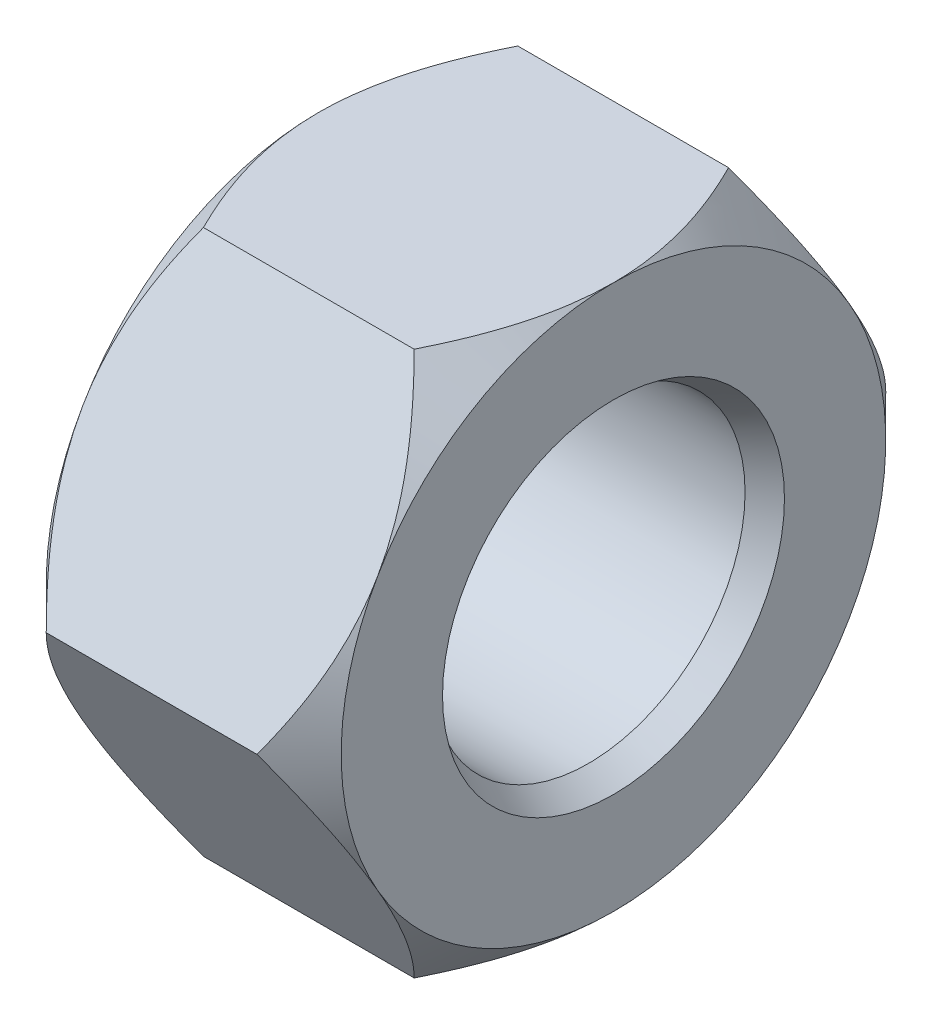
ISO-10303-21;
HEADER;
FILE_DESCRIPTION(('STEP AP214'),'2;1');
FILE_NAME('part.step','',(''),(''),'','','');
FILE_SCHEMA(('AUTOMOTIVE_DESIGN { 1 0 10303 214 1 1 1 1 }'));
ENDSEC;
DATA;
#1=APPLICATION_CONTEXT('core data for automotive mechanical design processes');
#2=APPLICATION_PROTOCOL_DEFINITION('international standard','automotive_design',2000,#1);
#3=PRODUCT_CONTEXT('',#1,'mechanical');
#4=PRODUCT('Part','Part','',(#3));
#5=PRODUCT_RELATED_PRODUCT_CATEGORY('part','',(#4));
#6=PRODUCT_DEFINITION_FORMATION('','',#4);
#7=PRODUCT_DEFINITION_CONTEXT('part definition',#1,'design');
#8=PRODUCT_DEFINITION('design','',#6,#7);
#9=PRODUCT_DEFINITION_SHAPE('','',#8);
#10=(LENGTH_UNIT() NAMED_UNIT(*) SI_UNIT(.MILLI.,.METRE.));
#11=(NAMED_UNIT(*) PLANE_ANGLE_UNIT() SI_UNIT($,.RADIAN.));
#12=(NAMED_UNIT(*) SI_UNIT($,.STERADIAN.) SOLID_ANGLE_UNIT());
#13=UNCERTAINTY_MEASURE_WITH_UNIT(LENGTH_MEASURE(1.E-05),#10,'distance_accuracy_value','');
#14=(GEOMETRIC_REPRESENTATION_CONTEXT(3) GLOBAL_UNCERTAINTY_ASSIGNED_CONTEXT((#13)) GLOBAL_UNIT_ASSIGNED_CONTEXT((#10,
#11,#12)) REPRESENTATION_CONTEXT('',''));
#15=CARTESIAN_POINT('',(0.,0.,0.));
#16=DIRECTION('',(0.,0.,1.));
#17=DIRECTION('',(1.,0.,0.));
#18=AXIS2_PLACEMENT_3D('',#15,#16,#17);
#19=CARTESIAN_POINT('',(5.50000000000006,0.,0.));
#20=DIRECTION('',(1.,0.,0.));
#21=DIRECTION('',(0.,0.,-1.));
#22=AXIS2_PLACEMENT_3D('',#19,#20,#21);
#23=CONICAL_SURFACE('',#22,17.5,0.785398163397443);
#24=CARTESIAN_POINT('',(7.97862016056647,-12.,-15.9732671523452));
#25=CARTESIAN_POINT('',(7.82640630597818,-12.,-15.7828820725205));
#26=CARTESIAN_POINT('',(7.67478830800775,-12.,-15.5920208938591));
#27=CARTESIAN_POINT('',(7.37286198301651,-12.,-15.2092614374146));
#28=CARTESIAN_POINT('',(7.22255367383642,-12.,-15.0173631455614));
#29=CARTESIAN_POINT('',(6.77371822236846,-12.,-14.4399181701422));
#30=CARTESIAN_POINT('',(6.47733985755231,-12.,-14.0526953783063));
#31=CARTESIAN_POINT('',(5.88931829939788,-12.,-13.2700758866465));
#32=CARTESIAN_POINT('',(5.5977277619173,-12.,-12.8746395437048));
#33=CARTESIAN_POINT('',(5.02323102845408,-12.,-12.0775304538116));
#34=CARTESIAN_POINT('',(4.74032425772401,-12.,-11.6758581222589));
#35=CARTESIAN_POINT('',(4.16343396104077,-12.,-10.833203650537));
#36=CARTESIAN_POINT('',(3.870331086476,-12.,-10.3916157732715));
#37=CARTESIAN_POINT('',(3.30013831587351,-12.,-9.49803386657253));
#38=CARTESIAN_POINT('',(3.02305146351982,-12.,-9.04603788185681));
#39=CARTESIAN_POINT('',(2.49061155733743,-12.,-8.13116520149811));
#40=CARTESIAN_POINT('',(2.23519556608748,-12.,-7.66832537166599));
#41=CARTESIAN_POINT('',(1.75178751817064,-12.,-6.72859173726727));
#42=CARTESIAN_POINT('',(1.52378145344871,-12.,-6.25170526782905));
#43=CARTESIAN_POINT('',(1.22290099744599,-12.,-5.55704908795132));
#44=CARTESIAN_POINT('',(1.13534682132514,-12.,-5.34561518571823));
#45=CARTESIAN_POINT('',(0.967871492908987,-12.,-4.91976383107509));
#46=CARTESIAN_POINT('',(0.887950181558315,-12.,-4.70534644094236));
#47=CARTESIAN_POINT('',(0.6609523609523,-12.,-4.05747876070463));
#48=CARTESIAN_POINT('',(0.526624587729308,-12.,-3.61937362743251));
#49=CARTESIAN_POINT('',(0.357702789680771,-12.,-2.95919379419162));
#50=CARTESIAN_POINT('',(0.307216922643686,-12.,-2.741103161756));
#51=CARTESIAN_POINT('',(0.217057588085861,-12.,-2.302708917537));
#52=CARTESIAN_POINT('',(0.177382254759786,-12.,-2.08240569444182));
#53=CARTESIAN_POINT('',(0.109583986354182,-12.,-1.64005709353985));
#54=CARTESIAN_POINT('',(0.0814593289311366,-12.,-1.41801198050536));
#55=CARTESIAN_POINT('',(0.0373213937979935,-12.,-0.972716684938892));
#56=CARTESIAN_POINT('',(0.0213078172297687,-12.,-0.749466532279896));
#57=CARTESIAN_POINT('',(0.00236561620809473,-12.,-0.316879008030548));
#58=CARTESIAN_POINT('',(-0.00134222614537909,-12.,-0.107575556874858));
#59=CARTESIAN_POINT('',(0.0022040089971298,-12.,0.310962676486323));
#60=CARTESIAN_POINT('',(0.00945935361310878,-12.,0.520197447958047));
#61=CARTESIAN_POINT('',(0.0347981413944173,-12.,0.937992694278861));
#62=CARTESIAN_POINT('',(0.0528806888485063,-12.,1.14655322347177));
#63=CARTESIAN_POINT('',(0.099531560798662,-12.,1.56250888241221));
#64=CARTESIAN_POINT('',(0.128101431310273,-12.,1.76990383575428));
#65=CARTESIAN_POINT('',(0.230146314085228,-12.,2.39767661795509));
#66=CARTESIAN_POINT('',(0.319442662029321,-12.,2.81555700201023));
#67=CARTESIAN_POINT('',(0.534054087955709,-12.,3.64171028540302));
#68=CARTESIAN_POINT('',(0.659369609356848,-12.,4.04998306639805));
#69=CARTESIAN_POINT('',(0.939172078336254,-12.,4.85424845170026));
#70=CARTESIAN_POINT('',(1.09352691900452,-12.,5.25028756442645));
#71=CARTESIAN_POINT('',(1.42619691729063,-12.,6.03225436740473));
#72=CARTESIAN_POINT('',(1.60452234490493,-12.,6.41817763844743));
#73=CARTESIAN_POINT('',(1.98090553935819,-12.,7.18166914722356));
#74=CARTESIAN_POINT('',(2.17902202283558,-12.,7.55920820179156));
#75=CARTESIAN_POINT('',(2.59065467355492,-12.,8.30566801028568));
#76=CARTESIAN_POINT('',(2.80416857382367,-12.,8.67459002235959));
#77=CARTESIAN_POINT('',(3.23273430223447,-12.,9.38685361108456));
#78=CARTESIAN_POINT('',(3.44718704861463,-12.,9.73055756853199));
#79=CARTESIAN_POINT('',(3.88530487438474,-12.,10.412060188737));
#80=CARTESIAN_POINT('',(4.10897062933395,-12.,10.7498584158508));
#81=CARTESIAN_POINT('',(4.56208975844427,-12.,11.4176445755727));
#82=CARTESIAN_POINT('',(4.79148350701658,-12.,11.7476731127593));
#83=CARTESIAN_POINT('',(5.2564862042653,-12.,12.4031910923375));
#84=CARTESIAN_POINT('',(5.4920934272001,-12.,12.7286817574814));
#85=CARTESIAN_POINT('',(5.73024656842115,-12.,13.0522658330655));
#86=B_SPLINE_CURVE_WITH_KNOTS('',3,(#24,#25,#26,#27,#28,#29,#30,#31,#32,#33,#34,#35,#36,#37,#38,
#39,#40,#41,#42,#43,#44,#45,#46,#47,#48,#49,#50,#51,#52,#53,#54,#55,#56,#57,#58,#59,#60,#61,#62,
#63,#64,#65,#66,#67,#68,#69,#70,#71,#72,#73,#74,#75,#76,#77,#78,#79,#80,#81,#82,#83,#84,#85),
.UNSPECIFIED.,.F.,.F.,(4,2,2,2,2,2,2,2,2,2,2,2,2,2,2,2,2,2,2,2,2,2,2,2,2,2,2,2,2,2,4),(0.,
0.731256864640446,1.46252367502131,2.92534173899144,4.3992058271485,5.87297215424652,
7.46273072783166,9.05279043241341,10.6380617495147,12.2225194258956,12.9089201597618,
13.5953065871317,14.9679507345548,15.6393089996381,16.3105513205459,16.9816935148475,
17.6528191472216,18.2805439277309,18.9083412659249,19.5360866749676,20.1639246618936,
21.4437965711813,22.7236842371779,23.9978843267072,25.2726320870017,26.5512809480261,
27.829741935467,29.0449308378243,30.260209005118,31.4658937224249,32.6712470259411),.UNSPECIFIED.);
#87=CARTESIAN_POINT('',(1.85640646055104,-12.,6.92820323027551));
#88=VERTEX_POINT('',#87);
#89=CARTESIAN_POINT('',(0.,-12.,0.));
#90=VERTEX_POINT('',#89);
#91=EDGE_CURVE('E289',#88,#90,#86,.F.);
#92=ORIENTED_EDGE('',*,*,#91,.F.);
#93=CARTESIAN_POINT('',(1.85652193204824,0.000200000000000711,13.8565219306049));
#94=CARTESIAN_POINT('',(1.73742850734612,-0.206106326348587,13.737410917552));
#95=CARTESIAN_POINT('',(1.62196918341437,-0.41402835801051,13.6173670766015));
#96=CARTESIAN_POINT('',(1.3994731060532,-0.833355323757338,13.3752685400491));
#97=CARTESIAN_POINT('',(1.29244095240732,-1.04476208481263,13.2532127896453));
#98=CARTESIAN_POINT('',(1.08750030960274,-1.47230711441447,13.006369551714));
#99=CARTESIAN_POINT('',(0.989647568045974,-1.6884655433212,12.8815704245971));
#100=CARTESIAN_POINT('',(0.805191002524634,-2.12433269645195,12.6299224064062));
#101=CARTESIAN_POINT('',(0.718585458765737,-2.3440408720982,12.5030738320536));
#102=CARTESIAN_POINT('',(0.559363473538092,-2.78347501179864,12.2493664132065));
#103=CARTESIAN_POINT('',(0.48654946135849,-3.0031469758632,12.1225387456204));
#104=CARTESIAN_POINT('',(0.354726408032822,-3.4455702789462,11.8671055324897));
#105=CARTESIAN_POINT('',(0.295715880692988,-3.66832128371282,11.7385001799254));
#106=CARTESIAN_POINT('',(0.19298543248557,-4.11594990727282,11.480061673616));
#107=CARTESIAN_POINT('',(0.149231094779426,-4.34082154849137,11.3502319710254));
#108=CARTESIAN_POINT('',(0.0779744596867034,-4.79245266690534,11.0894826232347));
#109=CARTESIAN_POINT('',(0.0504697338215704,-5.01921185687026,10.9585631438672));
#110=CARTESIAN_POINT('',(0.00435195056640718,-5.57180671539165,10.6395223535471));
#111=CARTESIAN_POINT('',(-0.00532569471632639,-5.89823966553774,10.4510562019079));
#112=CARTESIAN_POINT('',(0.0109189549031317,-6.550515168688,10.0744647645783));
#113=CARTESIAN_POINT('',(0.0368537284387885,-6.87635747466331,9.88633962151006));
#114=CARTESIAN_POINT('',(0.122792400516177,-7.52497050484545,9.51186271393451));
#115=CARTESIAN_POINT('',(0.18283439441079,-7.84773738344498,9.32551316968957));
#116=CARTESIAN_POINT('',(0.333723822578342,-8.48772338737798,8.95601707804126));
#117=CARTESIAN_POINT('',(0.424568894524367,-8.80494293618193,8.77287028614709));
#118=CARTESIAN_POINT('',(0.611458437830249,-9.36804564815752,8.44776278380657));
#119=CARTESIAN_POINT('',(0.70258641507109,-9.61517605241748,8.30508197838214));
#120=CARTESIAN_POINT('',(0.899526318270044,-10.1050009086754,8.02228146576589));
#121=CARTESIAN_POINT('',(1.0053386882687,-10.3476952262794,7.88216183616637));
#122=CARTESIAN_POINT('',(1.22927571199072,-10.8278834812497,7.60492501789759));
#123=CARTESIAN_POINT('',(1.3473616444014,-11.0653910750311,7.46779994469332));
#124=CARTESIAN_POINT('',(1.59429570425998,-11.5360086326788,7.19608877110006));
#125=CARTESIAN_POINT('',(1.72313723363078,-11.769121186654,7.06150117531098));
#126=CARTESIAN_POINT('',(1.85652193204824,-12.0002,6.92808776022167));
#127=B_SPLINE_CURVE_WITH_KNOTS('',3,(#93,#94,#95,#96,#97,#98,#99,#100,#101,#102,#103,#104,#105,
#106,#107,#108,#109,#110,#111,#112,#113,#114,#115,#116,#117,#118,#119,#120,#121,#122,#123,#124,
#125,#126),.UNSPECIFIED.,.F.,.F.,(4,2,2,2,2,2,2,2,2,2,2,2,2,2,2,2,4),(0.,0.799031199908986,
1.59849555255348,2.40253734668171,3.20645605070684,3.99780391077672,4.78906652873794,
5.57853238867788,6.36788023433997,7.49728680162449,8.6270892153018,9.75815602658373,
10.8891361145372,11.7873913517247,12.6856737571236,13.58120361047,14.4761880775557),.UNSPECIFIED.);
#128=CARTESIAN_POINT('',(0.,-6.00000000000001,10.3923048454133));
#129=VERTEX_POINT('',#128);
#130=EDGE_CURVE('E152',#129,#88,#127,.T.);
#131=ORIENTED_EDGE('',*,*,#130,.F.);
#132=CARTESIAN_POINT('',(0.,0.,0.));
#133=DIRECTION('',(-1.,0.,0.));
#134=DIRECTION('',(0.,0.,1.));
#135=AXIS2_PLACEMENT_3D('',#132,#133,#134);
#136=CIRCLE('',#135,12.);
#137=EDGE_CURVE('E288',#90,#129,#136,.T.);
#138=ORIENTED_EDGE('',*,*,#137,.F.);
#139=EDGE_LOOP('',(#92,#131,#138));
#140=FACE_BOUND('',#139,.T.);
#141=ADVANCED_FACE('F33',(#140),#23,.T.);
#142=CARTESIAN_POINT('',(1.85640646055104,-12.,-6.92820323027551));
#143=VERTEX_POINT('',#142);
#144=EDGE_CURVE('E209',#90,#143,#86,.F.);
#145=ORIENTED_EDGE('',*,*,#144,.F.);
#146=CARTESIAN_POINT('',(0.,-6.,-10.3923048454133));
#147=VERTEX_POINT('',#146);
#148=EDGE_CURVE('E212',#147,#90,#136,.T.);
#149=ORIENTED_EDGE('',*,*,#148,.F.);
#150=CARTESIAN_POINT('',(1.85652193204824,-12.0002,-6.92808776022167));
#151=CARTESIAN_POINT('',(1.73742850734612,-11.7938936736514,-7.04719877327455));
#152=CARTESIAN_POINT('',(1.62196918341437,-11.5859716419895,-7.16724261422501));
#153=CARTESIAN_POINT('',(1.3994731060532,-11.1666446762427,-7.40934115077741));
#154=CARTESIAN_POINT('',(1.29244095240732,-10.9552379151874,-7.53139690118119));
#155=CARTESIAN_POINT('',(1.08750030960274,-10.5276928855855,-7.7782401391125));
#156=CARTESIAN_POINT('',(0.989647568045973,-10.3115344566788,-7.90303926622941));
#157=CARTESIAN_POINT('',(0.805191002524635,-9.87566730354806,-8.15468728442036));
#158=CARTESIAN_POINT('',(0.718585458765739,-9.65595912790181,-8.28153585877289));
#159=CARTESIAN_POINT('',(0.559363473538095,-9.21652498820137,-8.53524327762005));
#160=CARTESIAN_POINT('',(0.486549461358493,-8.9968530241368,-8.66207094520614));
#161=CARTESIAN_POINT('',(0.354726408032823,-8.55442972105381,-8.91750415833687));
#162=CARTESIAN_POINT('',(0.295715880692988,-8.33167871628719,-9.04610951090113));
#163=CARTESIAN_POINT('',(0.192985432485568,-7.8840500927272,-9.30454801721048));
#164=CARTESIAN_POINT('',(0.149231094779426,-7.65917845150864,-9.43437771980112));
#165=CARTESIAN_POINT('',(0.0779744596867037,-7.20754733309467,-9.69512706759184));
#166=CARTESIAN_POINT('',(0.0504697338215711,-6.98078814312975,-9.82604654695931));
#167=CARTESIAN_POINT('',(0.00435195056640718,-6.42819328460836,-10.1450873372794));
#168=CARTESIAN_POINT('',(-0.00532569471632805,-6.10176033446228,-10.3335534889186));
#169=CARTESIAN_POINT('',(0.0109189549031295,-5.44948483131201,-10.7101449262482));
#170=CARTESIAN_POINT('',(0.0368537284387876,-5.1236425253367,-10.8982700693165));
#171=CARTESIAN_POINT('',(0.122792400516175,-4.47502949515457,-11.272746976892));
#172=CARTESIAN_POINT('',(0.182834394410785,-4.15226261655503,-11.4590965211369));
#173=CARTESIAN_POINT('',(0.333723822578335,-3.51227661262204,-11.8285926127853));
#174=CARTESIAN_POINT('',(0.424568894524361,-3.19505706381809,-12.0117394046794));
#175=CARTESIAN_POINT('',(0.611458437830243,-2.63195435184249,-12.3368469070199));
#176=CARTESIAN_POINT('',(0.702586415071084,-2.38482394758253,-12.4795277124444));
#177=CARTESIAN_POINT('',(0.899526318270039,-1.89499909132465,-12.7623282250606));
#178=CARTESIAN_POINT('',(1.00533868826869,-1.65230477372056,-12.9024478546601));
#179=CARTESIAN_POINT('',(1.22927571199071,-1.17211651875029,-13.1796846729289));
#180=CARTESIAN_POINT('',(1.3473616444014,-0.934608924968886,-13.3168097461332));
#181=CARTESIAN_POINT('',(1.59429570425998,-0.463991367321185,-13.5885209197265));
#182=CARTESIAN_POINT('',(1.72313723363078,-0.230878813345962,-13.7231085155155));
#183=CARTESIAN_POINT('',(1.85652193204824,0.000200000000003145,-13.8565219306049));
#184=B_SPLINE_CURVE_WITH_KNOTS('',3,(#150,#151,#152,#153,#154,#155,#156,#157,#158,#159,#160,
#161,#162,#163,#164,#165,#166,#167,#168,#169,#170,#171,#172,#173,#174,#175,#176,#177,#178,#179,
#180,#181,#182,#183),.UNSPECIFIED.,.F.,.F.,(4,2,2,2,2,2,2,2,2,2,2,2,2,2,2,2,4),(0.,
0.799031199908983,1.59849555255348,2.40253734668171,3.20645605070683,3.99780391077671,
4.78906652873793,5.57853238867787,6.36788023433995,7.49728680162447,8.62708921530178,
9.75815602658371,10.8891361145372,11.7873913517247,12.6856737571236,13.58120361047,
14.4761880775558),.UNSPECIFIED.);
#185=EDGE_CURVE('E199',#143,#147,#184,.T.);
#186=ORIENTED_EDGE('',*,*,#185,.F.);
#187=EDGE_LOOP('',(#145,#149,#186));
#188=FACE_BOUND('',#187,.T.);
#189=ADVANCED_FACE('F208',(#188),#23,.T.);
#190=CARTESIAN_POINT('',(1.85640646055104,0.,-13.856406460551));
#191=VERTEX_POINT('',#190);
#192=EDGE_CURVE('E215',#147,#191,#184,.T.);
#193=ORIENTED_EDGE('',*,*,#192,.F.);
#194=CARTESIAN_POINT('',(0.,6.,-10.3923048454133));
#195=VERTEX_POINT('',#194);
#196=EDGE_CURVE('E297',#195,#147,#136,.T.);
#197=ORIENTED_EDGE('',*,*,#196,.F.);
#198=CARTESIAN_POINT('',(1.85652193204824,-0.000199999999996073,-13.8565219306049));
#199=CARTESIAN_POINT('',(1.73742850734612,0.206106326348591,-13.737410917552));
#200=CARTESIAN_POINT('',(1.62196918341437,0.414028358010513,-13.6173670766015));
#201=CARTESIAN_POINT('',(1.3994731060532,0.833355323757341,-13.3752685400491));
#202=CARTESIAN_POINT('',(1.29244095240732,1.04476208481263,-13.2532127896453));
#203=CARTESIAN_POINT('',(1.08750030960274,1.47230711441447,-13.006369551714));
#204=CARTESIAN_POINT('',(0.989647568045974,1.6884655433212,-12.8815704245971));
#205=CARTESIAN_POINT('',(0.805191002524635,2.12433269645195,-12.6299224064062));
#206=CARTESIAN_POINT('',(0.718585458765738,2.3440408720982,-12.5030738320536));
#207=CARTESIAN_POINT('',(0.559363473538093,2.78347501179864,-12.2493664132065));
#208=CARTESIAN_POINT('',(0.486549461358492,3.0031469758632,-12.1225387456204));
#209=CARTESIAN_POINT('',(0.354726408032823,3.4455702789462,-11.8671055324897));
#210=CARTESIAN_POINT('',(0.295715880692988,3.66832128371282,-11.7385001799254));
#211=CARTESIAN_POINT('',(0.192985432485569,4.11594990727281,-11.480061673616));
#212=CARTESIAN_POINT('',(0.149231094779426,4.34082154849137,-11.3502319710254));
#213=CARTESIAN_POINT('',(0.0779744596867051,4.79245266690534,-11.0894826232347));
#214=CARTESIAN_POINT('',(0.0504697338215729,5.01921185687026,-10.9585631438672));
#215=CARTESIAN_POINT('',(0.00435195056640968,5.57180671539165,-10.6395223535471));
#216=CARTESIAN_POINT('',(-0.00532569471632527,5.89823966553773,-10.4510562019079));
#217=CARTESIAN_POINT('',(0.0109189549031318,6.550515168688,-10.0744647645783));
#218=CARTESIAN_POINT('',(0.0368537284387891,6.8763574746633,-9.88633962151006));
#219=CARTESIAN_POINT('',(0.122792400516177,7.52497050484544,-9.51186271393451));
#220=CARTESIAN_POINT('',(0.182834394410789,7.84773738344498,-9.32551316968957));
#221=CARTESIAN_POINT('',(0.33372382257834,8.48772338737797,-8.95601707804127));
#222=CARTESIAN_POINT('',(0.424568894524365,8.80494293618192,-8.77287028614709));
#223=CARTESIAN_POINT('',(0.611458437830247,9.36804564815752,-8.44776278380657));
#224=CARTESIAN_POINT('',(0.702586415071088,9.61517605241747,-8.30508197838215));
#225=CARTESIAN_POINT('',(0.899526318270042,10.1050009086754,-8.02228146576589));
#226=CARTESIAN_POINT('',(1.00533868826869,10.3476952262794,-7.88216183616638));
#227=CARTESIAN_POINT('',(1.22927571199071,10.8278834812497,-7.6049250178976));
#228=CARTESIAN_POINT('',(1.3473616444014,11.0653910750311,-7.46779994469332));
#229=CARTESIAN_POINT('',(1.59429570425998,11.5360086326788,-7.19608877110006));
#230=CARTESIAN_POINT('',(1.72313723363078,11.769121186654,-7.06150117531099));
#231=CARTESIAN_POINT('',(1.85652193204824,12.0002,-6.92808776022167));
#232=B_SPLINE_CURVE_WITH_KNOTS('',3,(#198,#199,#200,#201,#202,#203,#204,#205,#206,#207,#208,
#209,#210,#211,#212,#213,#214,#215,#216,#217,#218,#219,#220,#221,#222,#223,#224,#225,#226,#227,
#228,#229,#230,#231),.UNSPECIFIED.,.F.,.F.,(4,2,2,2,2,2,2,2,2,2,2,2,2,2,2,2,4),(0.,
0.799031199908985,1.59849555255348,2.40253734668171,3.20645605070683,3.99780391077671,
4.78906652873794,5.57853238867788,6.36788023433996,7.49728680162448,8.62708921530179,
9.75815602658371,10.8891361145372,11.7873913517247,12.6856737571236,13.58120361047,
14.4761880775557),.UNSPECIFIED.);
#233=EDGE_CURVE('E252',#191,#195,#232,.T.);
#234=ORIENTED_EDGE('',*,*,#233,.F.);
#235=EDGE_LOOP('',(#193,#197,#234));
#236=FACE_BOUND('',#235,.T.);
#237=ADVANCED_FACE('F355',(#236),#23,.T.);
#238=CARTESIAN_POINT('',(1.85640646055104,12.,-6.92820323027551));
#239=VERTEX_POINT('',#238);
#240=EDGE_CURVE('E248',#195,#239,#232,.T.);
#241=ORIENTED_EDGE('',*,*,#240,.F.);
#242=CARTESIAN_POINT('',(0.,12.,0.));
#243=VERTEX_POINT('',#242);
#244=EDGE_CURVE('E293',#243,#195,#136,.T.);
#245=ORIENTED_EDGE('',*,*,#244,.F.);
#246=CARTESIAN_POINT('',(7.97862016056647,12.,-15.9732671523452));
#247=CARTESIAN_POINT('',(7.82640630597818,12.,-15.7828820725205));
#248=CARTESIAN_POINT('',(7.67478830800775,12.,-15.5920208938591));
#249=CARTESIAN_POINT('',(7.37286198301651,12.,-15.2092614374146));
#250=CARTESIAN_POINT('',(7.22255367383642,12.,-15.0173631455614));
#251=CARTESIAN_POINT('',(6.77371822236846,12.,-14.4399181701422));
#252=CARTESIAN_POINT('',(6.47733985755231,12.,-14.0526953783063));
#253=CARTESIAN_POINT('',(5.88931829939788,12.,-13.2700758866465));
#254=CARTESIAN_POINT('',(5.59772776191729,12.,-12.8746395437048));
#255=CARTESIAN_POINT('',(5.02323102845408,12.,-12.0775304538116));
#256=CARTESIAN_POINT('',(4.74032425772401,12.,-11.6758581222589));
#257=CARTESIAN_POINT('',(4.16343396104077,12.,-10.833203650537));
#258=CARTESIAN_POINT('',(3.87033108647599,12.,-10.3916157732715));
#259=CARTESIAN_POINT('',(3.3001383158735,12.,-9.49803386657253));
#260=CARTESIAN_POINT('',(3.02305146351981,12.,-9.0460378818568));
#261=CARTESIAN_POINT('',(2.49061155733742,12.,-8.13116520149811));
#262=CARTESIAN_POINT('',(2.23519556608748,12.,-7.66832537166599));
#263=CARTESIAN_POINT('',(1.75178751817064,12.,-6.72859173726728));
#264=CARTESIAN_POINT('',(1.52378145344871,12.,-6.25170526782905));
#265=CARTESIAN_POINT('',(1.22290099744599,12.,-5.55704908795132));
#266=CARTESIAN_POINT('',(1.13534682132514,12.,-5.34561518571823));
#267=CARTESIAN_POINT('',(0.967871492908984,12.,-4.91976383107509));
#268=CARTESIAN_POINT('',(0.887950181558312,12.,-4.70534644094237));
#269=CARTESIAN_POINT('',(0.660952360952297,12.,-4.05747876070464));
#270=CARTESIAN_POINT('',(0.526624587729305,12.,-3.61937362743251));
#271=CARTESIAN_POINT('',(0.357702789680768,12.,-2.95919379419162));
#272=CARTESIAN_POINT('',(0.307216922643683,12.,-2.741103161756));
#273=CARTESIAN_POINT('',(0.217057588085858,12.,-2.302708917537));
#274=CARTESIAN_POINT('',(0.177382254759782,12.,-2.08240569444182));
#275=CARTESIAN_POINT('',(0.109583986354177,12.,-1.64005709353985));
#276=CARTESIAN_POINT('',(0.0814593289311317,12.,-1.41801198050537));
#277=CARTESIAN_POINT('',(0.0373213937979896,12.,-0.972716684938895));
#278=CARTESIAN_POINT('',(0.0213078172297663,12.,-0.749466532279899));
#279=CARTESIAN_POINT('',(0.00236561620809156,12.,-0.316879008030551));
#280=CARTESIAN_POINT('',(-0.00134222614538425,12.,-0.10757555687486));
#281=CARTESIAN_POINT('',(0.00220400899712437,12.,0.31096267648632));
#282=CARTESIAN_POINT('',(0.00945935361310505,12.,0.520197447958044));
#283=CARTESIAN_POINT('',(0.0347981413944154,12.,0.937992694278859));
#284=CARTESIAN_POINT('',(0.0528806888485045,12.,1.14655322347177));
#285=CARTESIAN_POINT('',(0.0995315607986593,12.,1.5625088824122));
#286=CARTESIAN_POINT('',(0.128101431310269,12.,1.76990383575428));
#287=CARTESIAN_POINT('',(0.230146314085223,12.,2.39767661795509));
#288=CARTESIAN_POINT('',(0.319442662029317,12.,2.81555700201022));
#289=CARTESIAN_POINT('',(0.534054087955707,12.,3.64171028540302));
#290=CARTESIAN_POINT('',(0.659369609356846,12.,4.04998306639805));
#291=CARTESIAN_POINT('',(0.939172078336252,12.,4.85424845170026));
#292=CARTESIAN_POINT('',(1.09352691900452,12.,5.25028756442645));
#293=CARTESIAN_POINT('',(1.42619691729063,12.,6.03225436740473));
#294=CARTESIAN_POINT('',(1.60452234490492,12.,6.41817763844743));
#295=CARTESIAN_POINT('',(1.98090553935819,12.,7.18166914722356));
#296=CARTESIAN_POINT('',(2.17902202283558,12.,7.55920820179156));
#297=CARTESIAN_POINT('',(2.59065467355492,12.,8.30566801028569));
#298=CARTESIAN_POINT('',(2.80416857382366,12.,8.6745900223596));
#299=CARTESIAN_POINT('',(3.23273430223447,12.,9.38685361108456));
#300=CARTESIAN_POINT('',(3.44718704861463,12.,9.73055756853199));
#301=CARTESIAN_POINT('',(3.88530487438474,12.,10.412060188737));
#302=CARTESIAN_POINT('',(4.10897062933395,12.,10.7498584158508));
#303=CARTESIAN_POINT('',(4.56208975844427,12.,11.4176445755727));
#304=CARTESIAN_POINT('',(4.79148350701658,12.,11.7476731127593));
#305=CARTESIAN_POINT('',(5.2564862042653,12.,12.4031910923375));
#306=CARTESIAN_POINT('',(5.49209342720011,12.,12.7286817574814));
#307=CARTESIAN_POINT('',(5.73024656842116,12.,13.0522658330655));
#308=B_SPLINE_CURVE_WITH_KNOTS('',3,(#246,#247,#248,#249,#250,#251,#252,#253,#254,#255,#256,
#257,#258,#259,#260,#261,#262,#263,#264,#265,#266,#267,#268,#269,#270,#271,#272,#273,#274,#275,
#276,#277,#278,#279,#280,#281,#282,#283,#284,#285,#286,#287,#288,#289,#290,#291,#292,#293,#294,
#295,#296,#297,#298,#299,#300,#301,#302,#303,#304,#305,#306,#307),.UNSPECIFIED.,.F.,.F.,(4,2,2,
2,2,2,2,2,2,2,2,2,2,2,2,2,2,2,2,2,2,2,2,2,2,2,2,2,2,2,4),(0.,0.731256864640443,1.46252367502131,
2.92534173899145,4.3992058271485,5.87297215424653,7.46273072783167,9.05279043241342,
10.6380617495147,12.2225194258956,12.9089201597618,13.5953065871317,14.9679507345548,
15.6393089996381,16.3105513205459,16.9816935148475,17.6528191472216,18.2805439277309,
18.9083412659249,19.5360866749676,20.1639246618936,21.4437965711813,22.7236842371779,
23.9978843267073,25.2726320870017,26.5512809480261,27.829741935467,29.0449308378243,
30.260209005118,31.4658937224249,32.6712470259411),.UNSPECIFIED.);
#309=EDGE_CURVE('E258',#239,#243,#308,.T.);
#310=ORIENTED_EDGE('',*,*,#309,.F.);
#311=EDGE_LOOP('',(#241,#245,#310));
#312=FACE_BOUND('',#311,.T.);
#313=ADVANCED_FACE('F357',(#312),#23,.T.);
#314=CARTESIAN_POINT('',(1.85640646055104,12.,6.92820323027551));
#315=VERTEX_POINT('',#314);
#316=EDGE_CURVE('E260',#243,#315,#308,.T.);
#317=ORIENTED_EDGE('',*,*,#316,.F.);
#318=CARTESIAN_POINT('',(0.,6.,10.3923048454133));
#319=VERTEX_POINT('',#318);
#320=EDGE_CURVE('E287',#319,#243,#136,.T.);
#321=ORIENTED_EDGE('',*,*,#320,.F.);
#322=CARTESIAN_POINT('',(1.85652193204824,12.0002,6.92808776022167));
#323=CARTESIAN_POINT('',(1.73742850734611,11.7938936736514,7.04719877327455));
#324=CARTESIAN_POINT('',(1.62196918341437,11.5859716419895,7.16724261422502));
#325=CARTESIAN_POINT('',(1.39947310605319,11.1666446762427,7.40934115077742));
#326=CARTESIAN_POINT('',(1.29244095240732,10.9552379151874,7.53139690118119));
#327=CARTESIAN_POINT('',(1.08750030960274,10.5276928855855,7.7782401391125));
#328=CARTESIAN_POINT('',(0.989647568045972,10.3115344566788,7.90303926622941));
#329=CARTESIAN_POINT('',(0.805191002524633,9.87566730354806,8.15468728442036));
#330=CARTESIAN_POINT('',(0.718585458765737,9.6559591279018,8.28153585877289));
#331=CARTESIAN_POINT('',(0.559363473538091,9.21652498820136,8.53524327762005));
#332=CARTESIAN_POINT('',(0.486549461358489,8.9968530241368,8.66207094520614));
#333=CARTESIAN_POINT('',(0.354726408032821,8.5544297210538,8.91750415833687));
#334=CARTESIAN_POINT('',(0.295715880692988,8.33167871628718,9.04610951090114));
#335=CARTESIAN_POINT('',(0.192985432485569,7.88405009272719,9.30454801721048));
#336=CARTESIAN_POINT('',(0.149231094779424,7.65917845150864,9.43437771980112));
#337=CARTESIAN_POINT('',(0.0779744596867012,7.20754733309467,9.69512706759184));
#338=CARTESIAN_POINT('',(0.050469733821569,6.98078814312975,9.82604654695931));
#339=CARTESIAN_POINT('',(0.00435195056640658,6.42819328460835,10.1450873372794));
#340=CARTESIAN_POINT('',(-0.00532569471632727,6.10176033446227,10.3335534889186));
#341=CARTESIAN_POINT('',(0.0109189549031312,5.44948483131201,10.7101449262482));
#342=CARTESIAN_POINT('',(0.036853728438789,5.1236425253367,10.8982700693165));
#343=CARTESIAN_POINT('',(0.122792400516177,4.47502949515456,11.272746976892));
#344=CARTESIAN_POINT('',(0.182834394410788,4.15226261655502,11.459096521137));
#345=CARTESIAN_POINT('',(0.333723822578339,3.51227661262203,11.8285926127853));
#346=CARTESIAN_POINT('',(0.424568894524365,3.19505706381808,12.0117394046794));
#347=CARTESIAN_POINT('',(0.611458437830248,2.63195435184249,12.33684690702));
#348=CARTESIAN_POINT('',(0.70258641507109,2.38482394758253,12.4795277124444));
#349=CARTESIAN_POINT('',(0.899526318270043,1.89499909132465,12.7623282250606));
#350=CARTESIAN_POINT('',(1.00533868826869,1.65230477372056,12.9024478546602));
#351=CARTESIAN_POINT('',(1.22927571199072,1.17211651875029,13.1796846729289));
#352=CARTESIAN_POINT('',(1.3473616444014,0.934608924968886,13.3168097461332));
#353=CARTESIAN_POINT('',(1.59429570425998,0.463991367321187,13.5885209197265));
#354=CARTESIAN_POINT('',(1.72313723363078,0.230878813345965,13.7231085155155));
#355=CARTESIAN_POINT('',(1.85652193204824,-0.000199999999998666,13.8565219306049));
#356=B_SPLINE_CURVE_WITH_KNOTS('',3,(#322,#323,#324,#325,#326,#327,#328,#329,#330,#331,#332,
#333,#334,#335,#336,#337,#338,#339,#340,#341,#342,#343,#344,#345,#346,#347,#348,#349,#350,#351,
#352,#353,#354,#355),.UNSPECIFIED.,.F.,.F.,(4,2,2,2,2,2,2,2,2,2,2,2,2,2,2,2,4),(0.,
0.799031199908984,1.59849555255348,2.40253734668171,3.20645605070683,3.99780391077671,
4.78906652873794,5.57853238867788,6.36788023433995,7.49728680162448,8.62708921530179,
9.75815602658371,10.8891361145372,11.7873913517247,12.6856737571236,13.58120361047,
14.4761880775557),.UNSPECIFIED.);
#357=EDGE_CURVE('E144',#315,#319,#356,.T.);
#358=ORIENTED_EDGE('',*,*,#357,.F.);
#359=EDGE_LOOP('',(#317,#321,#358));
#360=FACE_BOUND('',#359,.T.);
#361=ADVANCED_FACE('F291',(#360),#23,.T.);
#362=CARTESIAN_POINT('',(1.85640646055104,0.,13.856406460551));
#363=VERTEX_POINT('',#362);
#364=EDGE_CURVE('E135',#319,#363,#356,.T.);
#365=ORIENTED_EDGE('',*,*,#364,.F.);
#366=EDGE_CURVE('E281',#129,#319,#136,.T.);
#367=ORIENTED_EDGE('',*,*,#366,.F.);
#368=EDGE_CURVE('E55',#363,#129,#127,.T.);
#369=ORIENTED_EDGE('',*,*,#368,.F.);
#370=EDGE_LOOP('',(#365,#367,#369));
#371=FACE_BOUND('',#370,.T.);
#372=ADVANCED_FACE('F280',(#371),#23,.T.);
#373=CARTESIAN_POINT('',(13.,0.,0.));
#374=DIRECTION('',(-1.,0.,0.));
#375=DIRECTION('',(0.,0.,1.));
#376=AXIS2_PLACEMENT_3D('',#373,#374,#375);
#377=CONICAL_SURFACE('',#376,12.,0.785398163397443);
#378=CARTESIAN_POINT('',(11.1434780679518,12.0002,-6.92808776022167));
#379=CARTESIAN_POINT('',(11.2625714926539,11.7938936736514,-7.04719877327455));
#380=CARTESIAN_POINT('',(11.3780308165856,11.5859716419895,-7.16724261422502));
#381=CARTESIAN_POINT('',(11.6005268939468,11.1666446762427,-7.40934115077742));
#382=CARTESIAN_POINT('',(11.7075590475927,10.9552379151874,-7.5313969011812));
#383=CARTESIAN_POINT('',(11.9124996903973,10.5276928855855,-7.77824013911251));
#384=CARTESIAN_POINT('',(12.010352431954,10.3115344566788,-7.90303926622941));
#385=CARTESIAN_POINT('',(12.1948089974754,9.87566730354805,-8.15468728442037));
#386=CARTESIAN_POINT('',(12.2814145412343,9.6559591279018,-8.28153585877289));
#387=CARTESIAN_POINT('',(12.4406365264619,9.21652498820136,-8.53524327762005));
#388=CARTESIAN_POINT('',(12.5134505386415,8.9968530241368,-8.66207094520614));
#389=CARTESIAN_POINT('',(12.6452735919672,8.5544297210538,-8.91750415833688));
#390=CARTESIAN_POINT('',(12.704284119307,8.33167871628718,-9.04610951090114));
#391=CARTESIAN_POINT('',(12.8070145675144,7.88405009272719,-9.30454801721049));
#392=CARTESIAN_POINT('',(12.8507689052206,7.65917845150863,-9.43437771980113));
#393=CARTESIAN_POINT('',(12.9220255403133,7.20754733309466,-9.69512706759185));
#394=CARTESIAN_POINT('',(12.9495302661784,6.98078814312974,-9.82604654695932));
#395=CARTESIAN_POINT('',(12.9956480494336,6.42819328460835,-10.1450873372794));
#396=CARTESIAN_POINT('',(13.0053256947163,6.10176033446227,-10.3335534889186));
#397=CARTESIAN_POINT('',(12.9890810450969,5.449484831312,-10.7101449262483));
#398=CARTESIAN_POINT('',(12.9631462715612,5.12364252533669,-10.8982700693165));
#399=CARTESIAN_POINT('',(12.8772075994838,4.47502949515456,-11.272746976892));
#400=CARTESIAN_POINT('',(12.8171656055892,4.15226261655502,-11.459096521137));
#401=CARTESIAN_POINT('',(12.6662761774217,3.51227661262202,-11.8285926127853));
#402=CARTESIAN_POINT('',(12.5754311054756,3.19505706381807,-12.0117394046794));
#403=CARTESIAN_POINT('',(12.3885415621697,2.63195435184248,-12.33684690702));
#404=CARTESIAN_POINT('',(12.2974135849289,2.38482394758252,-12.4795277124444));
#405=CARTESIAN_POINT('',(12.10047368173,1.89499909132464,-12.7623282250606));
#406=CARTESIAN_POINT('',(11.9946613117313,1.65230477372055,-12.9024478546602));
#407=CARTESIAN_POINT('',(11.7707242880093,1.17211651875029,-13.1796846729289));
#408=CARTESIAN_POINT('',(11.6526383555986,0.934608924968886,-13.3168097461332));
#409=CARTESIAN_POINT('',(11.40570429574,0.463991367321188,-13.5885209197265));
#410=CARTESIAN_POINT('',(11.2768627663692,0.230878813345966,-13.7231085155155));
#411=CARTESIAN_POINT('',(11.1434780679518,-0.000199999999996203,-13.8565219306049));
#412=B_SPLINE_CURVE_WITH_KNOTS('',3,(#378,#379,#380,#381,#382,#383,#384,#385,#386,#387,#388,
#389,#390,#391,#392,#393,#394,#395,#396,#397,#398,#399,#400,#401,#402,#403,#404,#405,#406,#407,
#408,#409,#410,#411),.UNSPECIFIED.,.F.,.F.,(4,2,2,2,2,2,2,2,2,2,2,2,2,2,2,2,4),(0.,
0.799031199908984,1.59849555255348,2.40253734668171,3.20645605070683,3.99780391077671,
4.78906652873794,5.57853238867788,6.36788023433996,7.49728680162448,8.62708921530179,
9.75815602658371,10.8891361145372,11.7873913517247,12.6856737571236,13.58120361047,
14.4761880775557),.UNSPECIFIED.);
#413=CARTESIAN_POINT('',(11.143593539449,12.,-6.92820323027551));
#414=VERTEX_POINT('',#413);
#415=CARTESIAN_POINT('',(13.,6.,-10.3923048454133));
#416=VERTEX_POINT('',#415);
#417=EDGE_CURVE('E253',#414,#416,#412,.T.);
#418=ORIENTED_EDGE('',*,*,#417,.F.);
#419=CARTESIAN_POINT('',(5.02137983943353,12.,-15.9732671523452));
#420=CARTESIAN_POINT('',(5.17359369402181,12.,-15.7828820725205));
#421=CARTESIAN_POINT('',(5.32521169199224,12.,-15.5920208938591));
#422=CARTESIAN_POINT('',(5.62713801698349,12.,-15.2092614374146));
#423=CARTESIAN_POINT('',(5.77744632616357,12.,-15.0173631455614));
#424=CARTESIAN_POINT('',(6.22628177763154,12.,-14.4399181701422));
#425=CARTESIAN_POINT('',(6.52266014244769,12.,-14.0526953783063));
#426=CARTESIAN_POINT('',(7.11068170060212,12.,-13.2700758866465));
#427=CARTESIAN_POINT('',(7.4022722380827,12.,-12.8746395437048));
#428=CARTESIAN_POINT('',(7.97676897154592,12.,-12.0775304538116));
#429=CARTESIAN_POINT('',(8.25967574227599,12.,-11.6758581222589));
#430=CARTESIAN_POINT('',(8.83656603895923,12.,-10.833203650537));
#431=CARTESIAN_POINT('',(9.129668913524,12.,-10.3916157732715));
#432=CARTESIAN_POINT('',(9.69986168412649,12.,-9.49803386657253));
#433=CARTESIAN_POINT('',(9.97694853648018,12.,-9.0460378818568));
#434=CARTESIAN_POINT('',(10.5093884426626,12.,-8.13116520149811));
#435=CARTESIAN_POINT('',(10.7648044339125,12.,-7.66832537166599));
#436=CARTESIAN_POINT('',(11.2482124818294,12.,-6.72859173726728));
#437=CARTESIAN_POINT('',(11.4762185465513,12.,-6.25170526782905));
#438=CARTESIAN_POINT('',(11.777099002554,12.,-5.55704908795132));
#439=CARTESIAN_POINT('',(11.8646531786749,12.,-5.34561518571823));
#440=CARTESIAN_POINT('',(12.032128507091,12.,-4.91976383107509));
#441=CARTESIAN_POINT('',(12.1120498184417,12.,-4.70534644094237));
#442=CARTESIAN_POINT('',(12.3390476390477,12.,-4.05747876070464));
#443=CARTESIAN_POINT('',(12.4733754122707,12.,-3.61937362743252));
#444=CARTESIAN_POINT('',(12.6422972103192,12.,-2.95919379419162));
#445=CARTESIAN_POINT('',(12.6927830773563,12.,-2.741103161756));
#446=CARTESIAN_POINT('',(12.7829424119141,12.,-2.302708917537));
#447=CARTESIAN_POINT('',(12.8226177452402,12.,-2.08240569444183));
#448=CARTESIAN_POINT('',(12.8904160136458,12.,-1.64005709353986));
#449=CARTESIAN_POINT('',(12.9185406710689,12.,-1.41801198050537));
#450=CARTESIAN_POINT('',(12.962678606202,12.,-0.9727166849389));
#451=CARTESIAN_POINT('',(12.9786921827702,12.,-0.749466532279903));
#452=CARTESIAN_POINT('',(12.9976343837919,12.,-0.316879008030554));
#453=CARTESIAN_POINT('',(13.0013422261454,12.,-0.107575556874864));
#454=CARTESIAN_POINT('',(12.9977959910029,12.,0.310962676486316));
#455=CARTESIAN_POINT('',(12.9905406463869,12.,0.520197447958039));
#456=CARTESIAN_POINT('',(12.9652018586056,12.,0.937992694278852));
#457=CARTESIAN_POINT('',(12.9471193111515,12.,1.14655322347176));
#458=CARTESIAN_POINT('',(12.9004684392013,12.,1.5625088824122));
#459=CARTESIAN_POINT('',(12.8718985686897,12.,1.76990383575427));
#460=CARTESIAN_POINT('',(12.7698536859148,12.,2.39767661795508));
#461=CARTESIAN_POINT('',(12.6805573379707,12.,2.81555700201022));
#462=CARTESIAN_POINT('',(12.4659459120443,12.,3.64171028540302));
#463=CARTESIAN_POINT('',(12.3406303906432,12.,4.04998306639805));
#464=CARTESIAN_POINT('',(12.0608279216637,12.,4.85424845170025));
#465=CARTESIAN_POINT('',(11.9064730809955,12.,5.25028756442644));
#466=CARTESIAN_POINT('',(11.5738030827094,12.,6.03225436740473));
#467=CARTESIAN_POINT('',(11.3954776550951,12.,6.41817763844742));
#468=CARTESIAN_POINT('',(11.0190944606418,12.,7.18166914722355));
#469=CARTESIAN_POINT('',(10.8209779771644,12.,7.55920820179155));
#470=CARTESIAN_POINT('',(10.4093453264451,12.,8.30566801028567));
#471=CARTESIAN_POINT('',(10.1958314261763,12.,8.67459002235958));
#472=CARTESIAN_POINT('',(9.76726569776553,12.,9.38685361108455));
#473=CARTESIAN_POINT('',(9.55281295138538,12.,9.73055756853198));
#474=CARTESIAN_POINT('',(9.11469512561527,12.,10.412060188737));
#475=CARTESIAN_POINT('',(8.89102937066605,12.,10.7498584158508));
#476=CARTESIAN_POINT('',(8.43791024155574,12.,11.4176445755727));
#477=CARTESIAN_POINT('',(8.20851649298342,12.,11.7476731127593));
#478=CARTESIAN_POINT('',(7.74351379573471,12.,12.4031910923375));
#479=CARTESIAN_POINT('',(7.5079065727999,12.,12.7286817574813));
#480=CARTESIAN_POINT('',(7.26975343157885,12.,13.0522658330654));
#481=B_SPLINE_CURVE_WITH_KNOTS('',3,(#419,#420,#421,#422,#423,#424,#425,#426,#427,#428,#429,
#430,#431,#432,#433,#434,#435,#436,#437,#438,#439,#440,#441,#442,#443,#444,#445,#446,#447,#448,
#449,#450,#451,#452,#453,#454,#455,#456,#457,#458,#459,#460,#461,#462,#463,#464,#465,#466,#467,
#468,#469,#470,#471,#472,#473,#474,#475,#476,#477,#478,#479,#480),.UNSPECIFIED.,.F.,.F.,(4,2,2,
2,2,2,2,2,2,2,2,2,2,2,2,2,2,2,2,2,2,2,2,2,2,2,2,2,2,2,4),(0.,0.731256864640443,1.46252367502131,
2.92534173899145,4.3992058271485,5.87297215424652,7.46273072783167,9.05279043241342,
10.6380617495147,12.2225194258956,12.9089201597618,13.5953065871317,14.9679507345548,
15.6393089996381,16.3105513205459,16.9816935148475,17.6528191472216,18.2805439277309,
18.9083412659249,19.5360866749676,20.1639246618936,21.4437965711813,22.7236842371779,
23.9978843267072,25.2726320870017,26.5512809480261,27.829741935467,29.0449308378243,
30.260209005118,31.4658937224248,32.6712470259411),.UNSPECIFIED.);
#482=CARTESIAN_POINT('',(13.,12.,0.));
#483=VERTEX_POINT('',#482);
#484=EDGE_CURVE('E268',#483,#414,#481,.F.);
#485=ORIENTED_EDGE('',*,*,#484,.F.);
#486=CARTESIAN_POINT('',(13.,0.,0.));
#487=DIRECTION('',(-1.,0.,0.));
#488=DIRECTION('',(0.,0.,1.));
#489=AXIS2_PLACEMENT_3D('',#486,#487,#488);
#490=CIRCLE('',#489,12.);
#491=EDGE_CURVE('E304',#483,#416,#490,.T.);
#492=ORIENTED_EDGE('',*,*,#491,.T.);
#493=EDGE_LOOP('',(#418,#485,#492));
#494=FACE_BOUND('',#493,.T.);
#495=ADVANCED_FACE('F162',(#494),#377,.T.);
#496=CARTESIAN_POINT('',(11.143593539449,0.,-13.856406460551));
#497=VERTEX_POINT('',#496);
#498=EDGE_CURVE('E243',#416,#497,#412,.T.);
#499=ORIENTED_EDGE('',*,*,#498,.F.);
#500=CARTESIAN_POINT('',(13.,-6.,-10.3923048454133));
#501=VERTEX_POINT('',#500);
#502=EDGE_CURVE('E339',#416,#501,#490,.T.);
#503=ORIENTED_EDGE('',*,*,#502,.T.);
#504=CARTESIAN_POINT('',(11.1434780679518,0.000200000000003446,-13.8565219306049));
#505=CARTESIAN_POINT('',(11.2625714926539,-0.206106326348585,-13.737410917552));
#506=CARTESIAN_POINT('',(11.3780308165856,-0.414028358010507,-13.6173670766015));
#507=CARTESIAN_POINT('',(11.6005268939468,-0.833355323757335,-13.3752685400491));
#508=CARTESIAN_POINT('',(11.7075590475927,-1.04476208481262,-13.2532127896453));
#509=CARTESIAN_POINT('',(11.9124996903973,-1.47230711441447,-13.006369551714));
#510=CARTESIAN_POINT('',(12.010352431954,-1.68846554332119,-12.8815704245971));
#511=CARTESIAN_POINT('',(12.1948089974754,-2.12433269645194,-12.6299224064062));
#512=CARTESIAN_POINT('',(12.2814145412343,-2.3440408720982,-12.5030738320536));
#513=CARTESIAN_POINT('',(12.4406365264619,-2.78347501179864,-12.2493664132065));
#514=CARTESIAN_POINT('',(12.5134505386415,-3.0031469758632,-12.1225387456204));
#515=CARTESIAN_POINT('',(12.6452735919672,-3.4455702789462,-11.8671055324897));
#516=CARTESIAN_POINT('',(12.704284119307,-3.66832128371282,-11.7385001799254));
#517=CARTESIAN_POINT('',(12.8070145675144,-4.11594990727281,-11.480061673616));
#518=CARTESIAN_POINT('',(12.8507689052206,-4.34082154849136,-11.3502319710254));
#519=CARTESIAN_POINT('',(12.9220255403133,-4.79245266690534,-11.0894826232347));
#520=CARTESIAN_POINT('',(12.9495302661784,-5.01921185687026,-10.9585631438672));
#521=CARTESIAN_POINT('',(12.9956480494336,-5.57180671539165,-10.6395223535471));
#522=CARTESIAN_POINT('',(13.0053256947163,-5.89823966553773,-10.4510562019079));
#523=CARTESIAN_POINT('',(12.9890810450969,-6.550515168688,-10.0744647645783));
#524=CARTESIAN_POINT('',(12.9631462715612,-6.87635747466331,-9.88633962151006));
#525=CARTESIAN_POINT('',(12.8772075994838,-7.52497050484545,-9.51186271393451));
#526=CARTESIAN_POINT('',(12.8171656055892,-7.84773738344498,-9.32551316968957));
#527=CARTESIAN_POINT('',(12.6662761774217,-8.48772338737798,-8.95601707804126));
#528=CARTESIAN_POINT('',(12.5754311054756,-8.80494293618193,-8.77287028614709));
#529=CARTESIAN_POINT('',(12.3885415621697,-9.36804564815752,-8.44776278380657));
#530=CARTESIAN_POINT('',(12.2974135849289,-9.61517605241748,-8.30508197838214));
#531=CARTESIAN_POINT('',(12.10047368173,-10.1050009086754,-8.02228146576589));
#532=CARTESIAN_POINT('',(11.9946613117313,-10.3476952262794,-7.88216183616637));
#533=CARTESIAN_POINT('',(11.7707242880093,-10.8278834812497,-7.60492501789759));
#534=CARTESIAN_POINT('',(11.6526383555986,-11.0653910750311,-7.46779994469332));
#535=CARTESIAN_POINT('',(11.40570429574,-11.5360086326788,-7.19608877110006));
#536=CARTESIAN_POINT('',(11.2768627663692,-11.769121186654,-7.06150117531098));
#537=CARTESIAN_POINT('',(11.1434780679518,-12.0002,-6.92808776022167));
#538=B_SPLINE_CURVE_WITH_KNOTS('',3,(#504,#505,#506,#507,#508,#509,#510,#511,#512,#513,#514,
#515,#516,#517,#518,#519,#520,#521,#522,#523,#524,#525,#526,#527,#528,#529,#530,#531,#532,#533,
#534,#535,#536,#537),.UNSPECIFIED.,.F.,.F.,(4,2,2,2,2,2,2,2,2,2,2,2,2,2,2,2,4),(0.,
0.799031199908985,1.59849555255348,2.40253734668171,3.20645605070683,3.99780391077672,
4.78906652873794,5.57853238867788,6.36788023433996,7.49728680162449,8.6270892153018,
9.75815602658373,10.8891361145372,11.7873913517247,12.6856737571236,13.58120361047,
14.4761880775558),.UNSPECIFIED.);
#539=EDGE_CURVE('E219',#497,#501,#538,.T.);
#540=ORIENTED_EDGE('',*,*,#539,.F.);
#541=EDGE_LOOP('',(#499,#503,#540));
#542=FACE_BOUND('',#541,.T.);
#543=ADVANCED_FACE('F371',(#542),#377,.T.);
#544=CARTESIAN_POINT('',(11.143593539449,-12.,-6.92820323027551));
#545=VERTEX_POINT('',#544);
#546=EDGE_CURVE('E202',#501,#545,#538,.T.);
#547=ORIENTED_EDGE('',*,*,#546,.F.);
#548=CARTESIAN_POINT('',(13.,-12.,0.));
#549=VERTEX_POINT('',#548);
#550=EDGE_CURVE('E341',#501,#549,#490,.T.);
#551=ORIENTED_EDGE('',*,*,#550,.T.);
#552=CARTESIAN_POINT('',(5.02137983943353,-12.,-15.9732671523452));
#553=CARTESIAN_POINT('',(5.17359369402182,-12.,-15.7828820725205));
#554=CARTESIAN_POINT('',(5.32521169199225,-12.,-15.5920208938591));
#555=CARTESIAN_POINT('',(5.6271380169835,-12.,-15.2092614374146));
#556=CARTESIAN_POINT('',(5.77744632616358,-12.,-15.0173631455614));
#557=CARTESIAN_POINT('',(6.22628177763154,-12.,-14.4399181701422));
#558=CARTESIAN_POINT('',(6.5226601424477,-12.,-14.0526953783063));
#559=CARTESIAN_POINT('',(7.11068170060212,-12.,-13.2700758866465));
#560=CARTESIAN_POINT('',(7.40227223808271,-12.,-12.8746395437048));
#561=CARTESIAN_POINT('',(7.97676897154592,-12.,-12.0775304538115));
#562=CARTESIAN_POINT('',(8.25967574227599,-12.,-11.6758581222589));
#563=CARTESIAN_POINT('',(8.83656603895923,-12.,-10.8332036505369));
#564=CARTESIAN_POINT('',(9.129668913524,-12.,-10.3916157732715));
#565=CARTESIAN_POINT('',(9.69986168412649,-12.,-9.49803386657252));
#566=CARTESIAN_POINT('',(9.97694853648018,-12.,-9.0460378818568));
#567=CARTESIAN_POINT('',(10.5093884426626,-12.,-8.13116520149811));
#568=CARTESIAN_POINT('',(10.7648044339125,-12.,-7.66832537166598));
#569=CARTESIAN_POINT('',(11.2482124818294,-12.,-6.72859173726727));
#570=CARTESIAN_POINT('',(11.4762185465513,-12.,-6.25170526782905));
#571=CARTESIAN_POINT('',(11.777099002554,-12.,-5.55704908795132));
#572=CARTESIAN_POINT('',(11.8646531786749,-12.,-5.34561518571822));
#573=CARTESIAN_POINT('',(12.032128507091,-12.,-4.91976383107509));
#574=CARTESIAN_POINT('',(12.1120498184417,-12.,-4.70534644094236));
#575=CARTESIAN_POINT('',(12.3390476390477,-12.,-4.05747876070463));
#576=CARTESIAN_POINT('',(12.4733754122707,-12.,-3.61937362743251));
#577=CARTESIAN_POINT('',(12.6422972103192,-12.,-2.95919379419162));
#578=CARTESIAN_POINT('',(12.6927830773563,-12.,-2.741103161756));
#579=CARTESIAN_POINT('',(12.7829424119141,-12.,-2.302708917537));
#580=CARTESIAN_POINT('',(12.8226177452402,-12.,-2.08240569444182));
#581=CARTESIAN_POINT('',(12.8904160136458,-12.,-1.64005709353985));
#582=CARTESIAN_POINT('',(12.9185406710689,-12.,-1.41801198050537));
#583=CARTESIAN_POINT('',(12.962678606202,-12.,-0.972716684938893));
#584=CARTESIAN_POINT('',(12.9786921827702,-12.,-0.749466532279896));
#585=CARTESIAN_POINT('',(12.9976343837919,-12.,-0.316879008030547));
#586=CARTESIAN_POINT('',(13.0013422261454,-12.,-0.107575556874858));
#587=CARTESIAN_POINT('',(12.9977959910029,-12.,0.310962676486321));
#588=CARTESIAN_POINT('',(12.9905406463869,-12.,0.520197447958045));
#589=CARTESIAN_POINT('',(12.9652018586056,-12.,0.93799269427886));
#590=CARTESIAN_POINT('',(12.9471193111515,-12.,1.14655322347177));
#591=CARTESIAN_POINT('',(12.9004684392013,-12.,1.56250888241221));
#592=CARTESIAN_POINT('',(12.8718985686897,-12.,1.76990383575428));
#593=CARTESIAN_POINT('',(12.7698536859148,-12.,2.39767661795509));
#594=CARTESIAN_POINT('',(12.6805573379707,-12.,2.81555700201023));
#595=CARTESIAN_POINT('',(12.4659459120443,-12.,3.64171028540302));
#596=CARTESIAN_POINT('',(12.3406303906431,-12.,4.04998306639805));
#597=CARTESIAN_POINT('',(12.0608279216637,-12.,4.85424845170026));
#598=CARTESIAN_POINT('',(11.9064730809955,-12.,5.25028756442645));
#599=CARTESIAN_POINT('',(11.5738030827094,-12.,6.03225436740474));
#600=CARTESIAN_POINT('',(11.3954776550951,-12.,6.41817763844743));
#601=CARTESIAN_POINT('',(11.0190944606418,-12.,7.18166914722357));
#602=CARTESIAN_POINT('',(10.8209779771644,-12.,7.55920820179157));
#603=CARTESIAN_POINT('',(10.4093453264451,-12.,8.30566801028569));
#604=CARTESIAN_POINT('',(10.1958314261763,-12.,8.6745900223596));
#605=CARTESIAN_POINT('',(9.76726569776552,-12.,9.38685361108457));
#606=CARTESIAN_POINT('',(9.55281295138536,-12.,9.730557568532));
#607=CARTESIAN_POINT('',(9.11469512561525,-12.,10.412060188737));
#608=CARTESIAN_POINT('',(8.89102937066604,-12.,10.7498584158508));
#609=CARTESIAN_POINT('',(8.43791024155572,-12.,11.4176445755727));
#610=CARTESIAN_POINT('',(8.20851649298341,-12.,11.7476731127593));
#611=CARTESIAN_POINT('',(7.74351379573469,-12.,12.4031910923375));
#612=CARTESIAN_POINT('',(7.50790657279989,-12.,12.7286817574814));
#613=CARTESIAN_POINT('',(7.26975343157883,-12.,13.0522658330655));
#614=B_SPLINE_CURVE_WITH_KNOTS('',3,(#552,#553,#554,#555,#556,#557,#558,#559,#560,#561,#562,
#563,#564,#565,#566,#567,#568,#569,#570,#571,#572,#573,#574,#575,#576,#577,#578,#579,#580,#581,
#582,#583,#584,#585,#586,#587,#588,#589,#590,#591,#592,#593,#594,#595,#596,#597,#598,#599,#600,
#601,#602,#603,#604,#605,#606,#607,#608,#609,#610,#611,#612,#613),.UNSPECIFIED.,.F.,.F.,(4,2,2,
2,2,2,2,2,2,2,2,2,2,2,2,2,2,2,2,2,2,2,2,2,2,2,2,2,2,2,4),(0.,0.731256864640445,1.46252367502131,
2.92534173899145,4.3992058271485,5.87297215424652,7.46273072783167,9.05279043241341,
10.6380617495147,12.2225194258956,12.9089201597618,13.5953065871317,14.9679507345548,
15.639308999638,16.3105513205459,16.9816935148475,17.6528191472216,18.2805439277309,
18.9083412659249,19.5360866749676,20.1639246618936,21.4437965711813,22.7236842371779,
23.9978843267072,25.2726320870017,26.5512809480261,27.829741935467,29.0449308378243,
30.260209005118,31.4658937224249,32.6712470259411),.UNSPECIFIED.);
#615=EDGE_CURVE('E217',#545,#549,#614,.T.);
#616=ORIENTED_EDGE('',*,*,#615,.F.);
#617=EDGE_LOOP('',(#547,#551,#616));
#618=FACE_BOUND('',#617,.T.);
#619=ADVANCED_FACE('F375',(#618),#377,.T.);
#620=CARTESIAN_POINT('',(11.143593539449,12.,6.92820323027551));
#621=VERTEX_POINT('',#620);
#622=EDGE_CURVE('E264',#621,#483,#481,.F.);
#623=ORIENTED_EDGE('',*,*,#622,.F.);
#624=CARTESIAN_POINT('',(11.1434780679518,-0.000199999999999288,13.8565219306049));
#625=CARTESIAN_POINT('',(11.2625714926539,0.206106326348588,13.737410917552));
#626=CARTESIAN_POINT('',(11.3780308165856,0.41402835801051,13.6173670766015));
#627=CARTESIAN_POINT('',(11.6005268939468,0.833355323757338,13.3752685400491));
#628=CARTESIAN_POINT('',(11.7075590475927,1.04476208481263,13.2532127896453));
#629=CARTESIAN_POINT('',(11.9124996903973,1.47230711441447,13.006369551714));
#630=CARTESIAN_POINT('',(12.010352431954,1.6884655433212,12.8815704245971));
#631=CARTESIAN_POINT('',(12.1948089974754,2.12433269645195,12.6299224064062));
#632=CARTESIAN_POINT('',(12.2814145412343,2.3440408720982,12.5030738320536));
#633=CARTESIAN_POINT('',(12.4406365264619,2.78347501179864,12.2493664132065));
#634=CARTESIAN_POINT('',(12.5134505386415,3.0031469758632,12.1225387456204));
#635=CARTESIAN_POINT('',(12.6452735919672,3.4455702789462,11.8671055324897));
#636=CARTESIAN_POINT('',(12.704284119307,3.66832128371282,11.7385001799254));
#637=CARTESIAN_POINT('',(12.8070145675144,4.11594990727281,11.480061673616));
#638=CARTESIAN_POINT('',(12.8507689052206,4.34082154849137,11.3502319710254));
#639=CARTESIAN_POINT('',(12.9220255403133,4.79245266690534,11.0894826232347));
#640=CARTESIAN_POINT('',(12.9495302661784,5.01921185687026,10.9585631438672));
#641=CARTESIAN_POINT('',(12.9956480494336,5.57180671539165,10.6395223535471));
#642=CARTESIAN_POINT('',(13.0053256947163,5.89823966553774,10.4510562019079));
#643=CARTESIAN_POINT('',(12.9890810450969,6.550515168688,10.0744647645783));
#644=CARTESIAN_POINT('',(12.9631462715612,6.87635747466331,9.88633962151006));
#645=CARTESIAN_POINT('',(12.8772075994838,7.52497050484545,9.51186271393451));
#646=CARTESIAN_POINT('',(12.8171656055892,7.84773738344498,9.32551316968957));
#647=CARTESIAN_POINT('',(12.6662761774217,8.48772338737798,8.95601707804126));
#648=CARTESIAN_POINT('',(12.5754311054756,8.80494293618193,8.77287028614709));
#649=CARTESIAN_POINT('',(12.3885415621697,9.36804564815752,8.44776278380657));
#650=CARTESIAN_POINT('',(12.2974135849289,9.61517605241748,8.30508197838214));
#651=CARTESIAN_POINT('',(12.10047368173,10.1050009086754,8.02228146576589));
#652=CARTESIAN_POINT('',(11.9946613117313,10.3476952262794,7.88216183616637));
#653=CARTESIAN_POINT('',(11.7707242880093,10.8278834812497,7.60492501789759));
#654=CARTESIAN_POINT('',(11.6526383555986,11.0653910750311,7.46779994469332));
#655=CARTESIAN_POINT('',(11.40570429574,11.5360086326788,7.19608877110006));
#656=CARTESIAN_POINT('',(11.2768627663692,11.769121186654,7.06150117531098));
#657=CARTESIAN_POINT('',(11.1434780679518,12.0002,6.92808776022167));
#658=B_SPLINE_CURVE_WITH_KNOTS('',3,(#624,#625,#626,#627,#628,#629,#630,#631,#632,#633,#634,
#635,#636,#637,#638,#639,#640,#641,#642,#643,#644,#645,#646,#647,#648,#649,#650,#651,#652,#653,
#654,#655,#656,#657),.UNSPECIFIED.,.F.,.F.,(4,2,2,2,2,2,2,2,2,2,2,2,2,2,2,2,4),(0.,
0.799031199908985,1.59849555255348,2.40253734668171,3.20645605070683,3.99780391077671,
4.78906652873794,5.57853238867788,6.36788023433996,7.49728680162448,8.62708921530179,
9.75815602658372,10.8891361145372,11.7873913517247,12.6856737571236,13.58120361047,
14.4761880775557),.UNSPECIFIED.);
#659=CARTESIAN_POINT('',(13.,6.,10.3923048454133));
#660=VERTEX_POINT('',#659);
#661=EDGE_CURVE('E142',#660,#621,#658,.T.);
#662=ORIENTED_EDGE('',*,*,#661,.F.);
#663=EDGE_CURVE('E296',#660,#483,#490,.T.);
#664=ORIENTED_EDGE('',*,*,#663,.T.);
#665=EDGE_LOOP('',(#623,#662,#664));
#666=FACE_BOUND('',#665,.T.);
#667=ADVANCED_FACE('F337',(#666),#377,.T.);
#668=CARTESIAN_POINT('',(11.143593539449,-12.,6.92820323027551));
#669=VERTEX_POINT('',#668);
#670=EDGE_CURVE('E214',#549,#669,#614,.T.);
#671=ORIENTED_EDGE('',*,*,#670,.F.);
#672=CARTESIAN_POINT('',(13.,-6.00000000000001,10.3923048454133));
#673=VERTEX_POINT('',#672);
#674=EDGE_CURVE('E294',#549,#673,#490,.T.);
#675=ORIENTED_EDGE('',*,*,#674,.T.);
#676=CARTESIAN_POINT('',(11.1434780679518,-12.0002,6.92808776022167));
#677=CARTESIAN_POINT('',(11.2625714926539,-11.7938936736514,7.04719877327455));
#678=CARTESIAN_POINT('',(11.3780308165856,-11.5859716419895,7.16724261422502));
#679=CARTESIAN_POINT('',(11.6005268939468,-11.1666446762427,7.40934115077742));
#680=CARTESIAN_POINT('',(11.7075590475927,-10.9552379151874,7.53139690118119));
#681=CARTESIAN_POINT('',(11.9124996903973,-10.5276928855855,7.7782401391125));
#682=CARTESIAN_POINT('',(12.010352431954,-10.3115344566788,7.90303926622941));
#683=CARTESIAN_POINT('',(12.1948089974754,-9.87566730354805,8.15468728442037));
#684=CARTESIAN_POINT('',(12.2814145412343,-9.6559591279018,8.28153585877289));
#685=CARTESIAN_POINT('',(12.4406365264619,-9.21652498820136,8.53524327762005));
#686=CARTESIAN_POINT('',(12.5134505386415,-8.9968530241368,8.66207094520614));
#687=CARTESIAN_POINT('',(12.6452735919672,-8.5544297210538,8.91750415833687));
#688=CARTESIAN_POINT('',(12.704284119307,-8.33167871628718,9.04610951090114));
#689=CARTESIAN_POINT('',(12.8070145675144,-7.88405009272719,9.30454801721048));
#690=CARTESIAN_POINT('',(12.8507689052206,-7.65917845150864,9.43437771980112));
#691=CARTESIAN_POINT('',(12.9220255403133,-7.20754733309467,9.69512706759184));
#692=CARTESIAN_POINT('',(12.9495302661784,-6.98078814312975,9.82604654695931));
#693=CARTESIAN_POINT('',(12.9956480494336,-6.42819328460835,10.1450873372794));
#694=CARTESIAN_POINT('',(13.0053256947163,-6.10176033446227,10.3335534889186));
#695=CARTESIAN_POINT('',(12.9890810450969,-5.44948483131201,10.7101449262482));
#696=CARTESIAN_POINT('',(12.9631462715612,-5.1236425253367,10.8982700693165));
#697=CARTESIAN_POINT('',(12.8772075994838,-4.47502949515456,11.272746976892));
#698=CARTESIAN_POINT('',(12.8171656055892,-4.15226261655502,11.459096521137));
#699=CARTESIAN_POINT('',(12.6662761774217,-3.51227661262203,11.8285926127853));
#700=CARTESIAN_POINT('',(12.5754311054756,-3.19505706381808,12.0117394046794));
#701=CARTESIAN_POINT('',(12.3885415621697,-2.63195435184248,12.33684690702));
#702=CARTESIAN_POINT('',(12.2974135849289,-2.38482394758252,12.4795277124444));
#703=CARTESIAN_POINT('',(12.10047368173,-1.89499909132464,12.7623282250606));
#704=CARTESIAN_POINT('',(11.9946613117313,-1.65230477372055,12.9024478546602));
#705=CARTESIAN_POINT('',(11.7707242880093,-1.17211651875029,13.1796846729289));
#706=CARTESIAN_POINT('',(11.6526383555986,-0.934608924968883,13.3168097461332));
#707=CARTESIAN_POINT('',(11.40570429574,-0.463991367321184,13.5885209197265));
#708=CARTESIAN_POINT('',(11.2768627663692,-0.230878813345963,13.7231085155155));
#709=CARTESIAN_POINT('',(11.1434780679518,0.000200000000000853,13.8565219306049));
#710=B_SPLINE_CURVE_WITH_KNOTS('',3,(#676,#677,#678,#679,#680,#681,#682,#683,#684,#685,#686,
#687,#688,#689,#690,#691,#692,#693,#694,#695,#696,#697,#698,#699,#700,#701,#702,#703,#704,#705,
#706,#707,#708,#709),.UNSPECIFIED.,.F.,.F.,(4,2,2,2,2,2,2,2,2,2,2,2,2,2,2,2,4),(0.,
0.799031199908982,1.59849555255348,2.40253734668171,3.20645605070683,3.99780391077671,
4.78906652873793,5.57853238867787,6.36788023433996,7.49728680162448,8.62708921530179,
9.75815602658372,10.8891361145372,11.7873913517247,12.6856737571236,13.58120361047,
14.4761880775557),.UNSPECIFIED.);
#711=EDGE_CURVE('E48',#669,#673,#710,.T.);
#712=ORIENTED_EDGE('',*,*,#711,.F.);
#713=EDGE_LOOP('',(#671,#675,#712));
#714=FACE_BOUND('',#713,.T.);
#715=ADVANCED_FACE('F349',(#714),#377,.T.);
#716=CARTESIAN_POINT('',(11.143593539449,0.,13.856406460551));
#717=VERTEX_POINT('',#716);
#718=EDGE_CURVE('E132',#717,#660,#658,.T.);
#719=ORIENTED_EDGE('',*,*,#718,.F.);
#720=EDGE_CURVE('E120',#673,#717,#710,.T.);
#721=ORIENTED_EDGE('',*,*,#720,.F.);
#722=EDGE_CURVE('E140',#673,#660,#490,.T.);
#723=ORIENTED_EDGE('',*,*,#722,.T.);
#724=EDGE_LOOP('',(#719,#721,#723));
#725=FACE_BOUND('',#724,.T.);
#726=ADVANCED_FACE('F139',(#725),#377,.T.);
#727=CARTESIAN_POINT('',(13.,6.9,0.));
#728=DIRECTION('',(-1.,0.,0.));
#729=DIRECTION('',(0.,0.,1.));
#730=AXIS2_PLACEMENT_3D('',#727,#728,#729);
#731=PLANE('',#730);
#732=CARTESIAN_POINT('',(13.,0.,0.));
#733=DIRECTION('',(-1.,0.,0.));
#734=DIRECTION('',(0.,0.,1.));
#735=AXIS2_PLACEMENT_3D('',#732,#733,#734);
#736=CIRCLE('',#735,7.53508529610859);
#737=CARTESIAN_POINT('',(13.,0.,-7.53508529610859));
#738=VERTEX_POINT('',#737);
#739=EDGE_CURVE('E12',#738,#738,#736,.T.);
#740=ORIENTED_EDGE('',*,*,#739,.T.);
#741=EDGE_LOOP('',(#740));
#742=FACE_BOUND('',#741,.T.);
#743=ORIENTED_EDGE('',*,*,#663,.F.);
#744=ORIENTED_EDGE('',*,*,#722,.F.);
#745=ORIENTED_EDGE('',*,*,#674,.F.);
#746=ORIENTED_EDGE('',*,*,#550,.F.);
#747=ORIENTED_EDGE('',*,*,#502,.F.);
#748=ORIENTED_EDGE('',*,*,#491,.F.);
#749=EDGE_LOOP('',(#743,#744,#745,#746,#747,#748));
#750=FACE_BOUND('',#749,.T.);
#751=ADVANCED_FACE('F320',(#742,#750),#731,.F.);
#752=CARTESIAN_POINT('',(-26.7036316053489,0.,0.));
#753=DIRECTION('',(-1.,0.,0.));
#754=DIRECTION('',(0.,0.,1.));
#755=AXIS2_PLACEMENT_3D('',#752,#753,#754);
#756=CYLINDRICAL_SURFACE('',#755,6.9);
#757=CARTESIAN_POINT('',(0.63508529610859,0.,0.));
#758=DIRECTION('',(1.,0.,0.));
#759=DIRECTION('',(0.,0.,-1.));
#760=AXIS2_PLACEMENT_3D('',#757,#758,#759);
#761=CIRCLE('',#760,6.9);
#762=CARTESIAN_POINT('',(0.63508529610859,0.,-6.9));
#763=VERTEX_POINT('',#762);
#764=EDGE_CURVE('E307',#763,#763,#761,.F.);
#765=ORIENTED_EDGE('',*,*,#764,.T.);
#766=EDGE_LOOP('',(#765));
#767=FACE_BOUND('',#766,.T.);
#768=CARTESIAN_POINT('',(11.9,0.,0.));
#769=DIRECTION('',(-1.,0.,0.));
#770=DIRECTION('',(0.,0.,1.));
#771=AXIS2_PLACEMENT_3D('',#768,#769,#770);
#772=CIRCLE('',#771,6.9);
#773=CARTESIAN_POINT('',(11.9,0.,-6.9));
#774=VERTEX_POINT('',#773);
#775=EDGE_CURVE('E303',#774,#774,#772,.F.);
#776=ORIENTED_EDGE('',*,*,#775,.T.);
#777=EDGE_LOOP('',(#776));
#778=FACE_BOUND('',#777,.T.);
#779=ADVANCED_FACE('F317',(#767,#778),#756,.F.);
#780=CARTESIAN_POINT('',(0.,12.,0.));
#781=DIRECTION('',(1.,0.,0.));
#782=DIRECTION('',(0.,0.,-1.));
#783=AXIS2_PLACEMENT_3D('',#780,#781,#782);
#784=PLANE('',#783);
#785=CARTESIAN_POINT('',(0.,0.,0.));
#786=DIRECTION('',(1.,0.,0.));
#787=DIRECTION('',(0.,0.,-1.));
#788=AXIS2_PLACEMENT_3D('',#785,#786,#787);
#789=CIRCLE('',#788,8.00000000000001);
#790=CARTESIAN_POINT('',(0.,0.,-8.00000000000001));
#791=VERTEX_POINT('',#790);
#792=EDGE_CURVE('E41',#791,#791,#789,.T.);
#793=ORIENTED_EDGE('',*,*,#792,.T.);
#794=EDGE_LOOP('',(#793));
#795=FACE_BOUND('',#794,.T.);
#796=ORIENTED_EDGE('',*,*,#320,.T.);
#797=ORIENTED_EDGE('',*,*,#244,.T.);
#798=ORIENTED_EDGE('',*,*,#196,.T.);
#799=ORIENTED_EDGE('',*,*,#148,.T.);
#800=ORIENTED_EDGE('',*,*,#137,.T.);
#801=ORIENTED_EDGE('',*,*,#366,.T.);
#802=EDGE_LOOP('',(#796,#797,#798,#799,#800,#801));
#803=FACE_BOUND('',#802,.T.);
#804=ADVANCED_FACE('F285',(#795,#803),#784,.F.);
#805=CARTESIAN_POINT('',(13.,-12.,-6.92820323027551));
#806=DIRECTION('',(0.,-1.,0.));
#807=DIRECTION('',(0.,0.,-1.));
#808=AXIS2_PLACEMENT_3D('',#805,#806,#807);
#809=PLANE('',#808);
#810=ORIENTED_EDGE('',*,*,#91,.T.);
#811=ORIENTED_EDGE('',*,*,#144,.T.);
#812=DIRECTION('',(-1.,0.,0.));
#813=VECTOR('',#812,1.);
#814=CARTESIAN_POINT('',(13.,-12.,-6.92820323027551));
#815=LINE('',#814,#813);
#816=EDGE_CURVE('E128',#545,#143,#815,.T.);
#817=ORIENTED_EDGE('',*,*,#816,.F.);
#818=ORIENTED_EDGE('',*,*,#615,.T.);
#819=ORIENTED_EDGE('',*,*,#670,.T.);
#820=DIRECTION('',(-1.,0.,0.));
#821=VECTOR('',#820,1.);
#822=CARTESIAN_POINT('',(13.,-12.,6.92820323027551));
#823=LINE('',#822,#821);
#824=EDGE_CURVE('E137',#669,#88,#823,.T.);
#825=ORIENTED_EDGE('',*,*,#824,.T.);
#826=EDGE_LOOP('',(#810,#811,#817,#818,#819,#825));
#827=FACE_BOUND('',#826,.T.);
#828=ADVANCED_FACE('F176',(#827),#809,.T.);
#829=CARTESIAN_POINT('',(13.,0.,-13.856406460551));
#830=DIRECTION('',(0.,-0.5,-0.866025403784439));
#831=DIRECTION('',(0.,0.866025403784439,-0.5));
#832=AXIS2_PLACEMENT_3D('',#829,#830,#831);
#833=PLANE('',#832);
#834=ORIENTED_EDGE('',*,*,#185,.T.);
#835=ORIENTED_EDGE('',*,*,#192,.T.);
#836=DIRECTION('',(-1.,0.,0.));
#837=VECTOR('',#836,1.);
#838=CARTESIAN_POINT('',(13.,0.,-13.856406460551));
#839=LINE('',#838,#837);
#840=EDGE_CURVE('E191',#497,#191,#839,.T.);
#841=ORIENTED_EDGE('',*,*,#840,.F.);
#842=ORIENTED_EDGE('',*,*,#539,.T.);
#843=ORIENTED_EDGE('',*,*,#546,.T.);
#844=ORIENTED_EDGE('',*,*,#816,.T.);
#845=EDGE_LOOP('',(#834,#835,#841,#842,#843,#844));
#846=FACE_BOUND('',#845,.T.);
#847=ADVANCED_FACE('F198',(#846),#833,.T.);
#848=CARTESIAN_POINT('',(13.,12.,-6.92820323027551));
#849=DIRECTION('',(0.,0.5,-0.866025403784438));
#850=DIRECTION('',(0.,0.866025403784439,0.5));
#851=AXIS2_PLACEMENT_3D('',#848,#849,#850);
#852=PLANE('',#851);
#853=ORIENTED_EDGE('',*,*,#233,.T.);
#854=ORIENTED_EDGE('',*,*,#240,.T.);
#855=DIRECTION('',(-1.,0.,0.));
#856=VECTOR('',#855,1.);
#857=CARTESIAN_POINT('',(13.,12.,-6.92820323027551));
#858=LINE('',#857,#856);
#859=EDGE_CURVE('E188',#414,#239,#858,.T.);
#860=ORIENTED_EDGE('',*,*,#859,.F.);
#861=ORIENTED_EDGE('',*,*,#417,.T.);
#862=ORIENTED_EDGE('',*,*,#498,.T.);
#863=ORIENTED_EDGE('',*,*,#840,.T.);
#864=EDGE_LOOP('',(#853,#854,#860,#861,#862,#863));
#865=FACE_BOUND('',#864,.T.);
#866=ADVANCED_FACE('F236',(#865),#852,.T.);
#867=CARTESIAN_POINT('',(13.,12.,6.92820323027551));
#868=DIRECTION('',(0.,1.,0.));
#869=DIRECTION('',(0.,0.,1.));
#870=AXIS2_PLACEMENT_3D('',#867,#868,#869);
#871=PLANE('',#870);
#872=ORIENTED_EDGE('',*,*,#309,.T.);
#873=ORIENTED_EDGE('',*,*,#316,.T.);
#874=DIRECTION('',(-1.,0.,0.));
#875=VECTOR('',#874,1.);
#876=CARTESIAN_POINT('',(13.,12.,6.92820323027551));
#877=LINE('',#876,#875);
#878=EDGE_CURVE('E136',#621,#315,#877,.T.);
#879=ORIENTED_EDGE('',*,*,#878,.F.);
#880=ORIENTED_EDGE('',*,*,#622,.T.);
#881=ORIENTED_EDGE('',*,*,#484,.T.);
#882=ORIENTED_EDGE('',*,*,#859,.T.);
#883=EDGE_LOOP('',(#872,#873,#879,#880,#881,#882));
#884=FACE_BOUND('',#883,.T.);
#885=ADVANCED_FACE('F168',(#884),#871,.T.);
#886=CARTESIAN_POINT('',(13.,0.,13.856406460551));
#887=DIRECTION('',(0.,0.5,0.866025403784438));
#888=DIRECTION('',(0.,-0.866025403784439,0.5));
#889=AXIS2_PLACEMENT_3D('',#886,#887,#888);
#890=PLANE('',#889);
#891=ORIENTED_EDGE('',*,*,#357,.T.);
#892=ORIENTED_EDGE('',*,*,#364,.T.);
#893=DIRECTION('',(-1.,0.,0.));
#894=VECTOR('',#893,1.);
#895=CARTESIAN_POINT('',(13.,0.,13.856406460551));
#896=LINE('',#895,#894);
#897=EDGE_CURVE('E123',#717,#363,#896,.T.);
#898=ORIENTED_EDGE('',*,*,#897,.F.);
#899=ORIENTED_EDGE('',*,*,#718,.T.);
#900=ORIENTED_EDGE('',*,*,#661,.T.);
#901=ORIENTED_EDGE('',*,*,#878,.T.);
#902=EDGE_LOOP('',(#891,#892,#898,#899,#900,#901));
#903=FACE_BOUND('',#902,.T.);
#904=ADVANCED_FACE('F131',(#903),#890,.T.);
#905=CARTESIAN_POINT('',(13.,-12.,6.92820323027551));
#906=DIRECTION('',(0.,-0.5,0.866025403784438));
#907=DIRECTION('',(0.,-0.866025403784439,-0.5));
#908=AXIS2_PLACEMENT_3D('',#905,#906,#907);
#909=PLANE('',#908);
#910=ORIENTED_EDGE('',*,*,#368,.T.);
#911=ORIENTED_EDGE('',*,*,#130,.T.);
#912=ORIENTED_EDGE('',*,*,#824,.F.);
#913=ORIENTED_EDGE('',*,*,#711,.T.);
#914=ORIENTED_EDGE('',*,*,#720,.T.);
#915=ORIENTED_EDGE('',*,*,#897,.T.);
#916=EDGE_LOOP('',(#910,#911,#912,#913,#914,#915));
#917=FACE_BOUND('',#916,.T.);
#918=ADVANCED_FACE('F122',(#917),#909,.T.);
#919=CARTESIAN_POINT('',(0.63508529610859,0.,0.));
#920=DIRECTION('',(-1.,0.,0.));
#921=DIRECTION('',(0.,0.,1.));
#922=AXIS2_PLACEMENT_3D('',#919,#920,#921);
#923=CONICAL_SURFACE('',#922,6.9,1.0471975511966);
#924=ORIENTED_EDGE('',*,*,#792,.F.);
#925=EDGE_LOOP('',(#924));
#926=FACE_BOUND('',#925,.T.);
#927=ORIENTED_EDGE('',*,*,#764,.F.);
#928=EDGE_LOOP('',(#927));
#929=FACE_BOUND('',#928,.T.);
#930=ADVANCED_FACE('F175',(#926,#929),#923,.F.);
#931=CARTESIAN_POINT('',(13.,0.,0.));
#932=DIRECTION('',(1.,0.,0.));
#933=DIRECTION('',(0.,0.,-1.));
#934=AXIS2_PLACEMENT_3D('',#931,#932,#933);
#935=CONICAL_SURFACE('',#934,7.53508529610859,0.523598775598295);
#936=CARTESIAN_POINT('',(11.9,0.,-6.9));
#937=CARTESIAN_POINT('',(11.9114583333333,0.,-6.90661547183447));
#938=CARTESIAN_POINT('',(11.9229166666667,0.,-6.91323094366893));
#939=CARTESIAN_POINT('',(11.9458333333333,0.,-6.92646188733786));
#940=CARTESIAN_POINT('',(11.9572916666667,0.,-6.93307735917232));
#941=CARTESIAN_POINT('',(11.9802083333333,0.,-6.94630830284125));
#942=CARTESIAN_POINT('',(11.9916666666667,0.,-6.95292377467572));
#943=CARTESIAN_POINT('',(12.0145833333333,0.,-6.96615471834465));
#944=CARTESIAN_POINT('',(12.0260416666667,0.,-6.97277019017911));
#945=CARTESIAN_POINT('',(12.0489583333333,0.,-6.98600113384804));
#946=CARTESIAN_POINT('',(12.0604166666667,0.,-6.9926166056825));
#947=CARTESIAN_POINT('',(12.0833333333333,0.,-7.00584754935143));
#948=CARTESIAN_POINT('',(12.0947916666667,0.,-7.0124630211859));
#949=CARTESIAN_POINT('',(12.1177083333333,0.,-7.02569396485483));
#950=CARTESIAN_POINT('',(12.1291666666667,0.,-7.03230943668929));
#951=CARTESIAN_POINT('',(12.1520833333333,0.,-7.04554038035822));
#952=CARTESIAN_POINT('',(12.1635416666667,0.,-7.05215585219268));
#953=CARTESIAN_POINT('',(12.1864583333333,0.,-7.06538679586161));
#954=CARTESIAN_POINT('',(12.1979166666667,0.,-7.07200226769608));
#955=CARTESIAN_POINT('',(12.2208333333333,0.,-7.08523321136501));
#956=CARTESIAN_POINT('',(12.2322916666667,0.,-7.09184868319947));
#957=CARTESIAN_POINT('',(12.2552083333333,0.,-7.1050796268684));
#958=CARTESIAN_POINT('',(12.2666666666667,0.,-7.11169509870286));
#959=CARTESIAN_POINT('',(12.2895833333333,0.,-7.12492604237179));
#960=CARTESIAN_POINT('',(12.3010416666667,0.,-7.13154151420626));
#961=CARTESIAN_POINT('',(12.3239583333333,0.,-7.14477245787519));
#962=CARTESIAN_POINT('',(12.3354166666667,0.,-7.15138792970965));
#963=CARTESIAN_POINT('',(12.3583333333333,0.,-7.16461887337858));
#964=CARTESIAN_POINT('',(12.3697916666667,0.,-7.17123434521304));
#965=CARTESIAN_POINT('',(12.3927083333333,0.,-7.18446528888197));
#966=CARTESIAN_POINT('',(12.4041666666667,0.,-7.19108076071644));
#967=CARTESIAN_POINT('',(12.4270833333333,0.,-7.20431170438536));
#968=CARTESIAN_POINT('',(12.4385416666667,0.,-7.21092717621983));
#969=CARTESIAN_POINT('',(12.4614583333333,0.,-7.22415811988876));
#970=CARTESIAN_POINT('',(12.4729166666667,0.,-7.23077359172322));
#971=CARTESIAN_POINT('',(12.4958333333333,0.,-7.24400453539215));
#972=CARTESIAN_POINT('',(12.5072916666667,0.,-7.25062000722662));
#973=CARTESIAN_POINT('',(12.5302083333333,0.,-7.26385095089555));
#974=CARTESIAN_POINT('',(12.5416666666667,0.,-7.27046642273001));
#975=CARTESIAN_POINT('',(12.5645833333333,0.,-7.28369736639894));
#976=CARTESIAN_POINT('',(12.5760416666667,0.,-7.2903128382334));
#977=CARTESIAN_POINT('',(12.5989583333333,0.,-7.30354378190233));
#978=CARTESIAN_POINT('',(12.6104166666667,0.,-7.3101592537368));
#979=CARTESIAN_POINT('',(12.6333333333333,0.,-7.32339019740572));
#980=CARTESIAN_POINT('',(12.6447916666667,0.,-7.33000566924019));
#981=CARTESIAN_POINT('',(12.6677083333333,0.,-7.34323661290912));
#982=CARTESIAN_POINT('',(12.6791666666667,0.,-7.34985208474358));
#983=CARTESIAN_POINT('',(12.7020833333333,0.,-7.36308302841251));
#984=CARTESIAN_POINT('',(12.7135416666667,0.,-7.36969850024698));
#985=CARTESIAN_POINT('',(12.7364583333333,0.,-7.3829294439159));
#986=CARTESIAN_POINT('',(12.7479166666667,0.,-7.38954491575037));
#987=CARTESIAN_POINT('',(12.7708333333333,0.,-7.4027758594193));
#988=CARTESIAN_POINT('',(12.7822916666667,0.,-7.40939133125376));
#989=CARTESIAN_POINT('',(12.8052083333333,0.,-7.42262227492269));
#990=CARTESIAN_POINT('',(12.8166666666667,0.,-7.42923774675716));
#991=CARTESIAN_POINT('',(12.8395833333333,0.,-7.44246869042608));
#992=CARTESIAN_POINT('',(12.8510416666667,0.,-7.44908416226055));
#993=CARTESIAN_POINT('',(12.8739583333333,0.,-7.46231510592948));
#994=CARTESIAN_POINT('',(12.8854166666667,0.,-7.46893057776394));
#995=CARTESIAN_POINT('',(12.9083333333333,0.,-7.48216152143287));
#996=CARTESIAN_POINT('',(12.9197916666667,0.,-7.48877699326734));
#997=CARTESIAN_POINT('',(12.9427083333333,0.,-7.50200793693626));
#998=CARTESIAN_POINT('',(12.9541666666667,0.,-7.50862340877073));
#999=CARTESIAN_POINT('',(12.9770833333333,0.,-7.52185435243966));
#1000=CARTESIAN_POINT('',(12.9885416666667,0.,-7.52846982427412));
#1001=CARTESIAN_POINT('',(13.,0.,-7.53508529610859));
#1002=B_SPLINE_CURVE_WITH_KNOTS('',3,(#936,#937,#938,#939,#940,#941,#942,#943,#944,#945,#946,
#947,#948,#949,#950,#951,#952,#953,#954,#955,#956,#957,#958,#959,#960,#961,#962,#963,#964,#965,
#966,#967,#968,#969,#970,#971,#972,#973,#974,#975,#976,#977,#978,#979,#980,#981,#982,#983,#984,
#985,#986,#987,#988,#989,#990,#991,#992,#993,#994,#995,#996,#997,#998,#999,#1000,#1001),
.UNSPECIFIED.,.F.,.F.,(4,2,2,2,2,2,2,2,2,2,2,2,2,2,2,2,2,2,2,2,2,2,2,2,2,2,2,2,2,2,2,2,4),(0.,
0.0396928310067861,0.0793856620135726,0.119078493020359,0.158771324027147,0.198464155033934,
0.23815698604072,0.277849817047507,0.317542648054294,0.357235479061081,0.396928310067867,
0.436621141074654,0.476313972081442,0.516006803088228,0.555699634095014,0.595392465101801,
0.635085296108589,0.674778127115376,0.714470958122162,0.754163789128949,0.793856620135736,
0.833549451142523,0.873242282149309,0.912935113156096,0.952627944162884,0.99232077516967,
1.03201360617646,1.07170643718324,1.11139926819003,1.15109209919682,1.1907849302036,
1.23047776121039,1.27017059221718),.UNSPECIFIED.);
#1003=EDGE_CURVE('BSEAM35',#774,#738,#1002,.T.);
#1004=ORIENTED_EDGE('',*,*,#775,.F.);
#1005=ORIENTED_EDGE('',*,*,#739,.F.);
#1006=ORIENTED_EDGE('',*,*,#1003,.T.);
#1007=ORIENTED_EDGE('',*,*,#1003,.F.);
#1008=EDGE_LOOP('',(#1004,#1006,#1005,#1007));
#1009=FACE_BOUND('',#1008,.T.);
#1010=ADVANCED_FACE('F35',(#1009),#935,.F.);
#1011=CLOSED_SHELL('',(#141,#189,#237,#313,#361,#372,#495,#543,#619,#667,#715,#726,#751,#779,
#804,#828,#847,#866,#885,#904,#918,#930,#1010));
#1012=MANIFOLD_SOLID_BREP('B2',#1011);
#1013=ADVANCED_BREP_SHAPE_REPRESENTATION('',(#18,#1012),#14);
#1014=SHAPE_DEFINITION_REPRESENTATION(#9,#1013);
ENDSEC;
END-ISO-10303-21;
